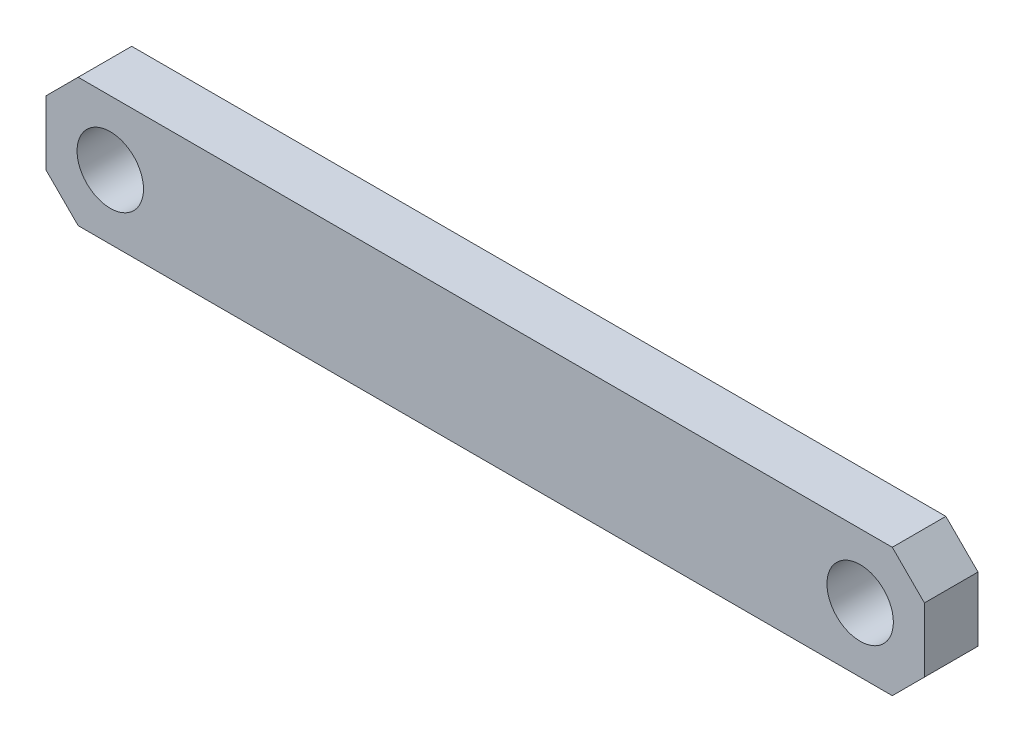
ISO-10303-21;
HEADER;
FILE_DESCRIPTION(('STEP AP214'),'2;1');
FILE_NAME('part.step','',(''),(''),'','','');
FILE_SCHEMA(('AUTOMOTIVE_DESIGN { 1 0 10303 214 1 1 1 1 }'));
ENDSEC;
DATA;
#1=APPLICATION_CONTEXT('core data for automotive mechanical design processes');
#2=APPLICATION_PROTOCOL_DEFINITION('international standard','automotive_design',2000,#1);
#3=PRODUCT_CONTEXT('',#1,'mechanical');
#4=PRODUCT('Part','Part','',(#3));
#5=PRODUCT_RELATED_PRODUCT_CATEGORY('part','',(#4));
#6=PRODUCT_DEFINITION_FORMATION('','',#4);
#7=PRODUCT_DEFINITION_CONTEXT('part definition',#1,'design');
#8=PRODUCT_DEFINITION('design','',#6,#7);
#9=PRODUCT_DEFINITION_SHAPE('','',#8);
#10=(LENGTH_UNIT() NAMED_UNIT(*) SI_UNIT(.MILLI.,.METRE.));
#11=(NAMED_UNIT(*) PLANE_ANGLE_UNIT() SI_UNIT($,.RADIAN.));
#12=(NAMED_UNIT(*) SI_UNIT($,.STERADIAN.) SOLID_ANGLE_UNIT());
#13=UNCERTAINTY_MEASURE_WITH_UNIT(LENGTH_MEASURE(1.E-05),#10,'distance_accuracy_value','');
#14=(GEOMETRIC_REPRESENTATION_CONTEXT(3) GLOBAL_UNCERTAINTY_ASSIGNED_CONTEXT((#13)) GLOBAL_UNIT_ASSIGNED_CONTEXT((#10,
#11,#12)) REPRESENTATION_CONTEXT('',''));
#15=CARTESIAN_POINT('',(0.,0.,0.));
#16=DIRECTION('',(0.,0.,1.));
#17=DIRECTION('',(1.,0.,0.));
#18=AXIS2_PLACEMENT_3D('',#15,#16,#17);
#19=CARTESIAN_POINT('',(-6.,2.99999999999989,-2.5));
#20=DIRECTION('',(-1.,0.,0.));
#21=DIRECTION('',(0.,0.,1.));
#22=AXIS2_PLACEMENT_3D('',#19,#20,#21);
#23=PLANE('',#22);
#24=DIRECTION('',(0.,-1.,0.));
#25=VECTOR('',#24,1.);
#26=CARTESIAN_POINT('',(-6.,2.99999999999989,2.5));
#27=LINE('',#26,#25);
#28=CARTESIAN_POINT('',(-6.,2.99999999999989,2.5));
#29=VERTEX_POINT('',#28);
#30=CARTESIAN_POINT('',(-6.,-3.,2.5));
#31=VERTEX_POINT('',#30);
#32=EDGE_CURVE('E139',#29,#31,#27,.T.);
#33=ORIENTED_EDGE('',*,*,#32,.F.);
#34=DIRECTION('',(0.,0.,1.));
#35=VECTOR('',#34,1.);
#36=CARTESIAN_POINT('',(-6.,2.99999999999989,-2.5));
#37=LINE('',#36,#35);
#38=CARTESIAN_POINT('',(-6.,2.99999999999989,-2.5));
#39=VERTEX_POINT('',#38);
#40=EDGE_CURVE('E11',#39,#29,#37,.T.);
#41=ORIENTED_EDGE('',*,*,#40,.F.);
#42=DIRECTION('',(0.,-1.,0.));
#43=VECTOR('',#42,1.);
#44=CARTESIAN_POINT('',(-6.,2.99999999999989,-2.5));
#45=LINE('',#44,#43);
#46=CARTESIAN_POINT('',(-6.,-3.,-2.5));
#47=VERTEX_POINT('',#46);
#48=EDGE_CURVE('E160',#39,#47,#45,.T.);
#49=ORIENTED_EDGE('',*,*,#48,.T.);
#50=DIRECTION('',(0.,0.,1.));
#51=VECTOR('',#50,1.);
#52=CARTESIAN_POINT('',(-6.,-3.,-2.5));
#53=LINE('',#52,#51);
#54=EDGE_CURVE('E97',#47,#31,#53,.T.);
#55=ORIENTED_EDGE('',*,*,#54,.T.);
#56=EDGE_LOOP('',(#33,#41,#49,#55));
#57=FACE_BOUND('',#56,.T.);
#58=ADVANCED_FACE('F41',(#57),#23,.T.);
#59=CARTESIAN_POINT('',(-2.99999999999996,5.99999999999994,-2.5));
#60=DIRECTION('',(-0.707106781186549,0.707106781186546,0.));
#61=DIRECTION('',(-0.707106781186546,-0.707106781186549,0.));
#62=AXIS2_PLACEMENT_3D('',#59,#60,#61);
#63=PLANE('',#62);
#64=DIRECTION('',(-0.707106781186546,-0.707106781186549,0.));
#65=VECTOR('',#64,1.);
#66=CARTESIAN_POINT('',(-2.99999999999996,5.99999999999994,2.5));
#67=LINE('',#66,#65);
#68=CARTESIAN_POINT('',(-2.99999999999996,5.99999999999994,2.5));
#69=VERTEX_POINT('',#68);
#70=EDGE_CURVE('E158',#69,#29,#67,.T.);
#71=ORIENTED_EDGE('',*,*,#70,.F.);
#72=DIRECTION('',(0.,0.,1.));
#73=VECTOR('',#72,1.);
#74=CARTESIAN_POINT('',(-2.99999999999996,5.99999999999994,-2.5));
#75=LINE('',#74,#73);
#76=CARTESIAN_POINT('',(-2.99999999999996,5.99999999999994,-2.5));
#77=VERTEX_POINT('',#76);
#78=EDGE_CURVE('E50',#77,#69,#75,.T.);
#79=ORIENTED_EDGE('',*,*,#78,.F.);
#80=DIRECTION('',(-0.707106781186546,-0.707106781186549,0.));
#81=VECTOR('',#80,1.);
#82=CARTESIAN_POINT('',(-2.99999999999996,5.99999999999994,-2.5));
#83=LINE('',#82,#81);
#84=EDGE_CURVE('E129',#77,#39,#83,.T.);
#85=ORIENTED_EDGE('',*,*,#84,.T.);
#86=ORIENTED_EDGE('',*,*,#40,.T.);
#87=EDGE_LOOP('',(#71,#79,#85,#86));
#88=FACE_BOUND('',#87,.T.);
#89=ADVANCED_FACE('F201',(#88),#63,.T.);
#90=CARTESIAN_POINT('',(73.,5.99999999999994,-2.5));
#91=DIRECTION('',(0.,1.,0.));
#92=DIRECTION('',(0.,0.,1.));
#93=AXIS2_PLACEMENT_3D('',#90,#91,#92);
#94=PLANE('',#93);
#95=DIRECTION('',(-1.,0.,0.));
#96=VECTOR('',#95,1.);
#97=CARTESIAN_POINT('',(73.,5.99999999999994,2.5));
#98=LINE('',#97,#96);
#99=CARTESIAN_POINT('',(73.,5.99999999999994,2.5));
#100=VERTEX_POINT('',#99);
#101=EDGE_CURVE('E116',#100,#69,#98,.T.);
#102=ORIENTED_EDGE('',*,*,#101,.F.);
#103=DIRECTION('',(0.,0.,1.));
#104=VECTOR('',#103,1.);
#105=CARTESIAN_POINT('',(73.,5.99999999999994,-2.5));
#106=LINE('',#105,#104);
#107=CARTESIAN_POINT('',(73.,5.99999999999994,-2.5));
#108=VERTEX_POINT('',#107);
#109=EDGE_CURVE('E111',#108,#100,#106,.T.);
#110=ORIENTED_EDGE('',*,*,#109,.F.);
#111=DIRECTION('',(-1.,0.,0.));
#112=VECTOR('',#111,1.);
#113=CARTESIAN_POINT('',(73.,5.99999999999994,-2.5));
#114=LINE('',#113,#112);
#115=EDGE_CURVE('E114',#108,#77,#114,.T.);
#116=ORIENTED_EDGE('',*,*,#115,.T.);
#117=ORIENTED_EDGE('',*,*,#78,.T.);
#118=EDGE_LOOP('',(#102,#110,#116,#117));
#119=FACE_BOUND('',#118,.T.);
#120=ADVANCED_FACE('F113',(#119),#94,.T.);
#121=CARTESIAN_POINT('',(75.9999999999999,3.,-2.5));
#122=DIRECTION('',(0.707106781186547,0.707106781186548,0.));
#123=DIRECTION('',(-0.707106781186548,0.707106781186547,0.));
#124=AXIS2_PLACEMENT_3D('',#121,#122,#123);
#125=PLANE('',#124);
#126=DIRECTION('',(-0.707106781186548,0.707106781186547,0.));
#127=VECTOR('',#126,1.);
#128=CARTESIAN_POINT('',(75.9999999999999,3.,2.5));
#129=LINE('',#128,#127);
#130=CARTESIAN_POINT('',(75.9999999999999,3.,2.5));
#131=VERTEX_POINT('',#130);
#132=EDGE_CURVE('E155',#131,#100,#129,.T.);
#133=ORIENTED_EDGE('',*,*,#132,.F.);
#134=DIRECTION('',(0.,0.,1.));
#135=VECTOR('',#134,1.);
#136=CARTESIAN_POINT('',(75.9999999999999,3.,-2.5));
#137=LINE('',#136,#135);
#138=CARTESIAN_POINT('',(75.9999999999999,3.,-2.5));
#139=VERTEX_POINT('',#138);
#140=EDGE_CURVE('E121',#139,#131,#137,.T.);
#141=ORIENTED_EDGE('',*,*,#140,.F.);
#142=DIRECTION('',(-0.707106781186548,0.707106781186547,0.));
#143=VECTOR('',#142,1.);
#144=CARTESIAN_POINT('',(75.9999999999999,3.,-2.5));
#145=LINE('',#144,#143);
#146=EDGE_CURVE('E127',#139,#108,#145,.T.);
#147=ORIENTED_EDGE('',*,*,#146,.T.);
#148=ORIENTED_EDGE('',*,*,#109,.T.);
#149=EDGE_LOOP('',(#133,#141,#147,#148));
#150=FACE_BOUND('',#149,.T.);
#151=ADVANCED_FACE('F131',(#150),#125,.T.);
#152=CARTESIAN_POINT('',(75.9999999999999,-3.,-2.5));
#153=DIRECTION('',(1.,0.,0.));
#154=DIRECTION('',(0.,0.,-1.));
#155=AXIS2_PLACEMENT_3D('',#152,#153,#154);
#156=PLANE('',#155);
#157=DIRECTION('',(0.,1.,0.));
#158=VECTOR('',#157,1.);
#159=CARTESIAN_POINT('',(75.9999999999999,-3.,2.5));
#160=LINE('',#159,#158);
#161=CARTESIAN_POINT('',(75.9999999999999,-3.,2.5));
#162=VERTEX_POINT('',#161);
#163=EDGE_CURVE('E152',#162,#131,#160,.T.);
#164=ORIENTED_EDGE('',*,*,#163,.F.);
#165=DIRECTION('',(0.,0.,1.));
#166=VECTOR('',#165,1.);
#167=CARTESIAN_POINT('',(75.9999999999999,-3.,-2.5));
#168=LINE('',#167,#166);
#169=CARTESIAN_POINT('',(75.9999999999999,-3.,-2.5));
#170=VERTEX_POINT('',#169);
#171=EDGE_CURVE('E164',#170,#162,#168,.T.);
#172=ORIENTED_EDGE('',*,*,#171,.F.);
#173=DIRECTION('',(0.,1.,0.));
#174=VECTOR('',#173,1.);
#175=CARTESIAN_POINT('',(75.9999999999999,-3.,-2.5));
#176=LINE('',#175,#174);
#177=EDGE_CURVE('E132',#170,#139,#176,.T.);
#178=ORIENTED_EDGE('',*,*,#177,.T.);
#179=ORIENTED_EDGE('',*,*,#140,.T.);
#180=EDGE_LOOP('',(#164,#172,#178,#179));
#181=FACE_BOUND('',#180,.T.);
#182=ADVANCED_FACE('F214',(#181),#156,.T.);
#183=CARTESIAN_POINT('',(73.,-5.99999999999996,-2.5));
#184=DIRECTION('',(0.707106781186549,-0.707106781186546,0.));
#185=DIRECTION('',(0.707106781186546,0.707106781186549,0.));
#186=AXIS2_PLACEMENT_3D('',#183,#184,#185);
#187=PLANE('',#186);
#188=DIRECTION('',(0.707106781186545,0.707106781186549,0.));
#189=VECTOR('',#188,1.);
#190=CARTESIAN_POINT('',(73.,-5.99999999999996,2.5));
#191=LINE('',#190,#189);
#192=CARTESIAN_POINT('',(73.,-5.99999999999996,2.5));
#193=VERTEX_POINT('',#192);
#194=EDGE_CURVE('E149',#193,#162,#191,.T.);
#195=ORIENTED_EDGE('',*,*,#194,.F.);
#196=DIRECTION('',(0.,0.,1.));
#197=VECTOR('',#196,1.);
#198=CARTESIAN_POINT('',(73.,-5.99999999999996,-2.5));
#199=LINE('',#198,#197);
#200=CARTESIAN_POINT('',(73.,-5.99999999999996,-2.5));
#201=VERTEX_POINT('',#200);
#202=EDGE_CURVE('E166',#201,#193,#199,.T.);
#203=ORIENTED_EDGE('',*,*,#202,.F.);
#204=DIRECTION('',(0.707106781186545,0.707106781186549,0.));
#205=VECTOR('',#204,1.);
#206=CARTESIAN_POINT('',(73.,-5.99999999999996,-2.5));
#207=LINE('',#206,#205);
#208=EDGE_CURVE('E134',#201,#170,#207,.T.);
#209=ORIENTED_EDGE('',*,*,#208,.T.);
#210=ORIENTED_EDGE('',*,*,#171,.T.);
#211=EDGE_LOOP('',(#195,#203,#209,#210));
#212=FACE_BOUND('',#211,.T.);
#213=ADVANCED_FACE('F192',(#212),#187,.T.);
#214=CARTESIAN_POINT('',(-2.99999999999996,-5.99999999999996,-2.5));
#215=DIRECTION('',(0.,-1.,0.));
#216=DIRECTION('',(0.,0.,-1.));
#217=AXIS2_PLACEMENT_3D('',#214,#215,#216);
#218=PLANE('',#217);
#219=DIRECTION('',(1.,0.,0.));
#220=VECTOR('',#219,1.);
#221=CARTESIAN_POINT('',(-2.99999999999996,-5.99999999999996,2.5));
#222=LINE('',#221,#220);
#223=CARTESIAN_POINT('',(-2.99999999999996,-5.99999999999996,2.5));
#224=VERTEX_POINT('',#223);
#225=EDGE_CURVE('E146',#224,#193,#222,.T.);
#226=ORIENTED_EDGE('',*,*,#225,.F.);
#227=DIRECTION('',(0.,0.,1.));
#228=VECTOR('',#227,1.);
#229=CARTESIAN_POINT('',(-2.99999999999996,-5.99999999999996,-2.5));
#230=LINE('',#229,#228);
#231=CARTESIAN_POINT('',(-2.99999999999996,-5.99999999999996,-2.5));
#232=VERTEX_POINT('',#231);
#233=EDGE_CURVE('E168',#232,#224,#230,.T.);
#234=ORIENTED_EDGE('',*,*,#233,.F.);
#235=DIRECTION('',(1.,0.,0.));
#236=VECTOR('',#235,1.);
#237=CARTESIAN_POINT('',(-2.99999999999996,-5.99999999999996,-2.5));
#238=LINE('',#237,#236);
#239=EDGE_CURVE('E186',#232,#201,#238,.T.);
#240=ORIENTED_EDGE('',*,*,#239,.T.);
#241=ORIENTED_EDGE('',*,*,#202,.T.);
#242=EDGE_LOOP('',(#226,#234,#240,#241));
#243=FACE_BOUND('',#242,.T.);
#244=ADVANCED_FACE('F197',(#243),#218,.T.);
#245=CARTESIAN_POINT('',(-6.,-3.,-2.5));
#246=DIRECTION('',(-0.707106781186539,-0.707106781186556,0.));
#247=DIRECTION('',(0.707106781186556,-0.707106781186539,0.));
#248=AXIS2_PLACEMENT_3D('',#245,#246,#247);
#249=PLANE('',#248);
#250=DIRECTION('',(0.707106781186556,-0.707106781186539,0.));
#251=VECTOR('',#250,1.);
#252=CARTESIAN_POINT('',(-6.,-3.,2.5));
#253=LINE('',#252,#251);
#254=EDGE_CURVE('E142',#31,#224,#253,.T.);
#255=ORIENTED_EDGE('',*,*,#254,.F.);
#256=ORIENTED_EDGE('',*,*,#54,.F.);
#257=DIRECTION('',(0.707106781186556,-0.707106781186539,0.));
#258=VECTOR('',#257,1.);
#259=CARTESIAN_POINT('',(-6.,-3.,-2.5));
#260=LINE('',#259,#258);
#261=EDGE_CURVE('E184',#47,#232,#260,.T.);
#262=ORIENTED_EDGE('',*,*,#261,.T.);
#263=ORIENTED_EDGE('',*,*,#233,.T.);
#264=EDGE_LOOP('',(#255,#256,#262,#263));
#265=FACE_BOUND('',#264,.T.);
#266=ADVANCED_FACE('F198',(#265),#249,.T.);
#267=CARTESIAN_POINT('',(0.,0.,-2.5));
#268=DIRECTION('',(0.,0.,1.));
#269=DIRECTION('',(1.,0.,0.));
#270=AXIS2_PLACEMENT_3D('',#267,#268,#269);
#271=PLANE('',#270);
#272=CARTESIAN_POINT('',(0.,0.,-2.5));
#273=DIRECTION('',(0.,0.,1.));
#274=DIRECTION('',(1.,0.,0.));
#275=AXIS2_PLACEMENT_3D('',#272,#273,#274);
#276=CIRCLE('',#275,3.1);
#277=CARTESIAN_POINT('',(3.1,0.,-2.5));
#278=VERTEX_POINT('',#277);
#279=EDGE_CURVE('E143',#278,#278,#276,.T.);
#280=ORIENTED_EDGE('',*,*,#279,.T.);
#281=EDGE_LOOP('',(#280));
#282=FACE_BOUND('',#281,.T.);
#283=CARTESIAN_POINT('',(70.,0.,-2.5));
#284=DIRECTION('',(0.,0.,1.));
#285=DIRECTION('',(1.,0.,0.));
#286=AXIS2_PLACEMENT_3D('',#283,#284,#285);
#287=CIRCLE('',#286,3.1);
#288=CARTESIAN_POINT('',(73.1,0.,-2.5));
#289=VERTEX_POINT('',#288);
#290=EDGE_CURVE('E172',#289,#289,#287,.T.);
#291=ORIENTED_EDGE('',*,*,#290,.T.);
#292=EDGE_LOOP('',(#291));
#293=FACE_BOUND('',#292,.T.);
#294=ORIENTED_EDGE('',*,*,#48,.F.);
#295=ORIENTED_EDGE('',*,*,#84,.F.);
#296=ORIENTED_EDGE('',*,*,#115,.F.);
#297=ORIENTED_EDGE('',*,*,#146,.F.);
#298=ORIENTED_EDGE('',*,*,#177,.F.);
#299=ORIENTED_EDGE('',*,*,#208,.F.);
#300=ORIENTED_EDGE('',*,*,#239,.F.);
#301=ORIENTED_EDGE('',*,*,#261,.F.);
#302=EDGE_LOOP('',(#294,#295,#296,#297,#298,#299,#300,#301));
#303=FACE_BOUND('',#302,.T.);
#304=ADVANCED_FACE('F125',(#282,#293,#303),#271,.F.);
#305=CARTESIAN_POINT('',(0.,0.,2.5));
#306=DIRECTION('',(0.,0.,1.));
#307=DIRECTION('',(1.,0.,0.));
#308=AXIS2_PLACEMENT_3D('',#305,#306,#307);
#309=PLANE('',#308);
#310=CARTESIAN_POINT('',(0.,0.,2.5));
#311=DIRECTION('',(0.,0.,1.));
#312=DIRECTION('',(1.,0.,0.));
#313=AXIS2_PLACEMENT_3D('',#310,#311,#312);
#314=CIRCLE('',#313,3.1);
#315=CARTESIAN_POINT('',(3.1,0.,2.5));
#316=VERTEX_POINT('',#315);
#317=EDGE_CURVE('E44',#316,#316,#314,.T.);
#318=ORIENTED_EDGE('',*,*,#317,.F.);
#319=EDGE_LOOP('',(#318));
#320=FACE_BOUND('',#319,.T.);
#321=CARTESIAN_POINT('',(70.,0.,2.5));
#322=DIRECTION('',(0.,0.,1.));
#323=DIRECTION('',(1.,0.,0.));
#324=AXIS2_PLACEMENT_3D('',#321,#322,#323);
#325=CIRCLE('',#324,3.1);
#326=CARTESIAN_POINT('',(73.1,0.,2.5));
#327=VERTEX_POINT('',#326);
#328=EDGE_CURVE('E170',#327,#327,#325,.T.);
#329=ORIENTED_EDGE('',*,*,#328,.F.);
#330=EDGE_LOOP('',(#329));
#331=FACE_BOUND('',#330,.T.);
#332=ORIENTED_EDGE('',*,*,#32,.T.);
#333=ORIENTED_EDGE('',*,*,#254,.T.);
#334=ORIENTED_EDGE('',*,*,#225,.T.);
#335=ORIENTED_EDGE('',*,*,#194,.T.);
#336=ORIENTED_EDGE('',*,*,#163,.T.);
#337=ORIENTED_EDGE('',*,*,#132,.T.);
#338=ORIENTED_EDGE('',*,*,#101,.T.);
#339=ORIENTED_EDGE('',*,*,#70,.T.);
#340=EDGE_LOOP('',(#332,#333,#334,#335,#336,#337,#338,#339));
#341=FACE_BOUND('',#340,.T.);
#342=ADVANCED_FACE('F200',(#320,#331,#341),#309,.T.);
#343=CARTESIAN_POINT('',(70.,0.,-250.));
#344=DIRECTION('',(0.,0.,1.));
#345=DIRECTION('',(1.,0.,0.));
#346=AXIS2_PLACEMENT_3D('',#343,#344,#345);
#347=CYLINDRICAL_SURFACE('',#346,3.1);
#348=ORIENTED_EDGE('',*,*,#328,.T.);
#349=EDGE_LOOP('',(#348));
#350=FACE_BOUND('',#349,.T.);
#351=ORIENTED_EDGE('',*,*,#290,.F.);
#352=EDGE_LOOP('',(#351));
#353=FACE_BOUND('',#352,.T.);
#354=ADVANCED_FACE('F229',(#350,#353),#347,.F.);
#355=CARTESIAN_POINT('',(0.,0.,-250.));
#356=DIRECTION('',(0.,0.,1.));
#357=DIRECTION('',(1.,0.,0.));
#358=AXIS2_PLACEMENT_3D('',#355,#356,#357);
#359=CYLINDRICAL_SURFACE('',#358,3.1);
#360=ORIENTED_EDGE('',*,*,#317,.T.);
#361=EDGE_LOOP('',(#360));
#362=FACE_BOUND('',#361,.T.);
#363=ORIENTED_EDGE('',*,*,#279,.F.);
#364=EDGE_LOOP('',(#363));
#365=FACE_BOUND('',#364,.T.);
#366=ADVANCED_FACE('F234',(#362,#365),#359,.F.);
#367=CLOSED_SHELL('',(#58,#89,#120,#151,#182,#213,#244,#266,#304,#342,#354,#366));
#368=MANIFOLD_SOLID_BREP('B2',#367);
#369=ADVANCED_BREP_SHAPE_REPRESENTATION('',(#18,#368),#14);
#370=SHAPE_DEFINITION_REPRESENTATION(#9,#369);
ENDSEC;
END-ISO-10303-21;
